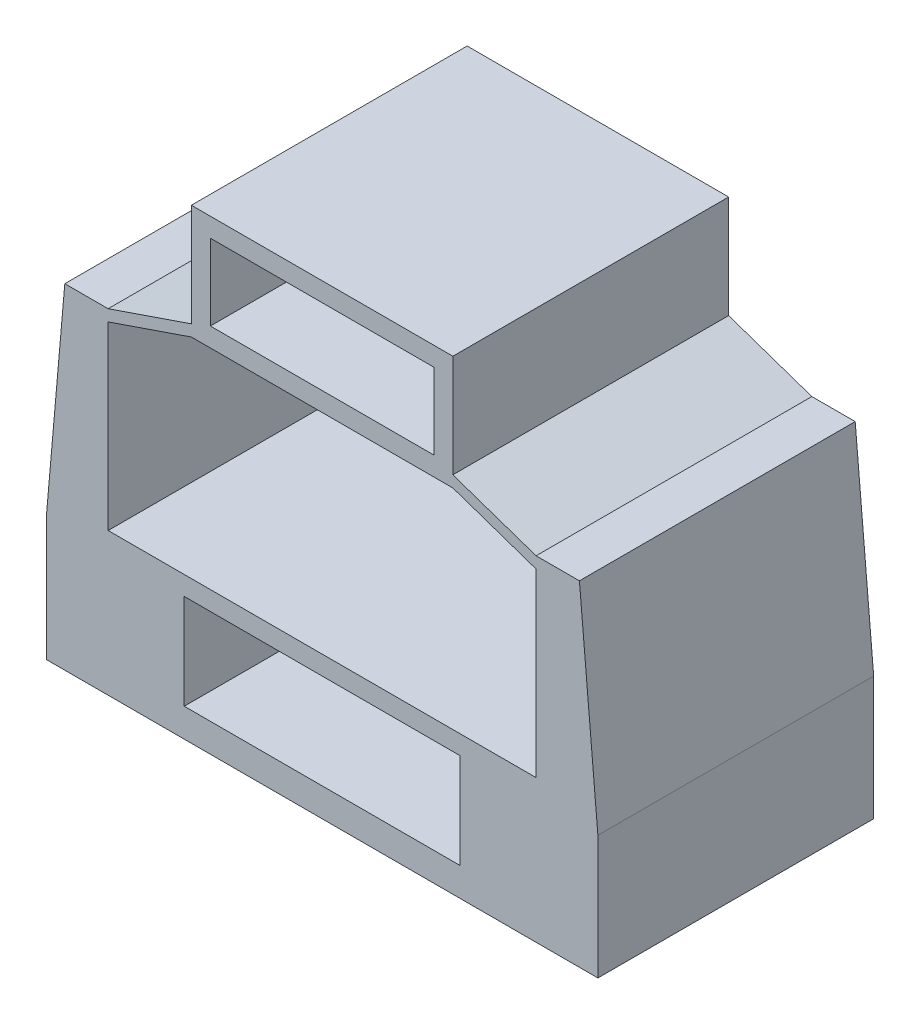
from build123d import *

# Parameters (mm, degrees)
EXTRUDE_1_DEPTH = 5.8


with BuildPart() as part:
    # Model → Extrude 1 (new body)
    with BuildSketch(Plane.XY):
        Polygon((0, 0), (0, 0.6), (-2.9, 0.6), (-2.9, 2.6), (0, 2.6), (0, 3), (-4.5, 3), (-4.5, 6.8), (-2.75, 7.4), (0, 7.4), (0, 7.8), (-2.35, 7.8), (-2.35, 9.4), (0, 9.4), (0, 9.8), (-2.75, 9.8), (-2.75, 7.64), (-4.5, 7.04), (-5.411550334, 7.04), (-5.8, 2.6), (-5.8, 0), align=None)
    extrude_1 = extrude(amount=EXTRUDE_1_DEPTH)

    # Mirror 1: Extrude 1 across plane
    add(extrude_1.mirror(Plane(origin=(0, 0, 0), x_dir=(0, 0, 1), z_dir=(1, 0, 0))))


solid = part.part
